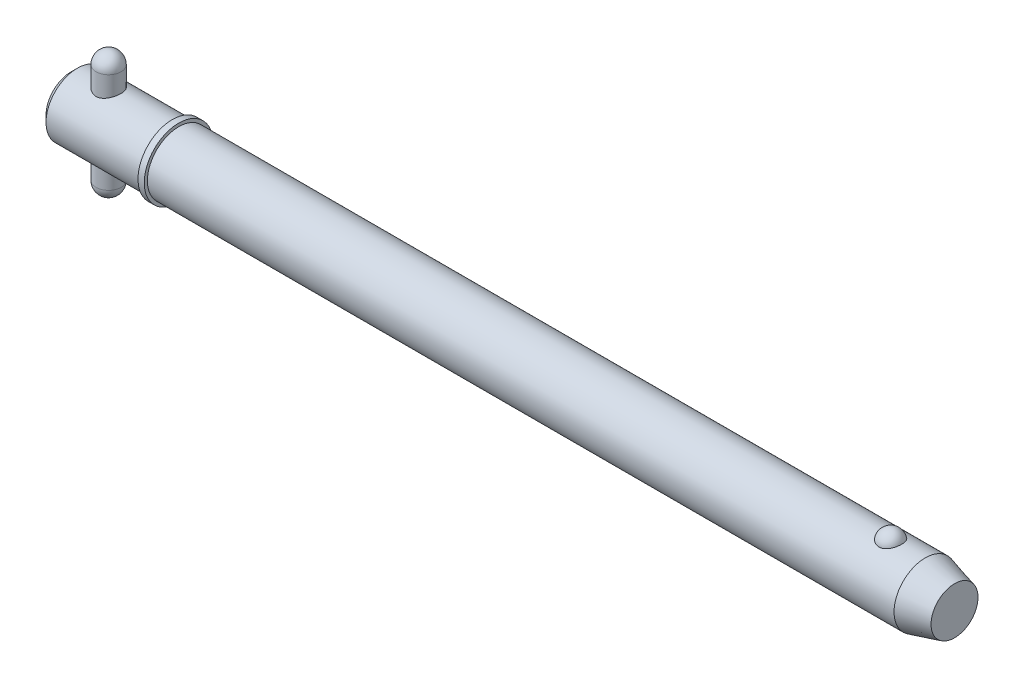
ISO-10303-21;
HEADER;
FILE_DESCRIPTION(('STEP AP214'),'2;1');
FILE_NAME('part.step','',(''),(''),'','','');
FILE_SCHEMA(('AUTOMOTIVE_DESIGN { 1 0 10303 214 1 1 1 1 }'));
ENDSEC;
DATA;
#1=APPLICATION_CONTEXT('core data for automotive mechanical design processes');
#2=APPLICATION_PROTOCOL_DEFINITION('international standard','automotive_design',2000,#1);
#3=PRODUCT_CONTEXT('',#1,'mechanical');
#4=PRODUCT('Part','Part','',(#3));
#5=PRODUCT_RELATED_PRODUCT_CATEGORY('part','',(#4));
#6=PRODUCT_DEFINITION_FORMATION('','',#4);
#7=PRODUCT_DEFINITION_CONTEXT('part definition',#1,'design');
#8=PRODUCT_DEFINITION('design','',#6,#7);
#9=PRODUCT_DEFINITION_SHAPE('','',#8);
#10=(LENGTH_UNIT() NAMED_UNIT(*) SI_UNIT(.MILLI.,.METRE.));
#11=(NAMED_UNIT(*) PLANE_ANGLE_UNIT() SI_UNIT($,.RADIAN.));
#12=(NAMED_UNIT(*) SI_UNIT($,.STERADIAN.) SOLID_ANGLE_UNIT());
#13=UNCERTAINTY_MEASURE_WITH_UNIT(LENGTH_MEASURE(1.E-05),#10,'distance_accuracy_value','');
#14=(GEOMETRIC_REPRESENTATION_CONTEXT(3) GLOBAL_UNCERTAINTY_ASSIGNED_CONTEXT((#13)) GLOBAL_UNIT_ASSIGNED_CONTEXT((#10,
#11,#12)) REPRESENTATION_CONTEXT('',''));
#15=CARTESIAN_POINT('',(0.,0.,0.));
#16=DIRECTION('',(0.,0.,1.));
#17=DIRECTION('',(1.,0.,0.));
#18=AXIS2_PLACEMENT_3D('',#15,#16,#17);
#19=CARTESIAN_POINT('',(9.525,15.875,0.));
#20=DIRECTION('',(0.,-1.,0.));
#21=DIRECTION('',(0.,0.,-1.));
#22=AXIS2_PLACEMENT_3D('',#19,#20,#21);
#23=CYLINDRICAL_SURFACE('',#22,3.175);
#24=CARTESIAN_POINT('',(9.525,-12.7,0.));
#25=DIRECTION('',(0.,-1.,0.));
#26=DIRECTION('',(0.,0.,-1.));
#27=AXIS2_PLACEMENT_3D('',#24,#25,#26);
#28=CIRCLE('',#27,3.175);
#29=CARTESIAN_POINT('',(9.525,-12.7,-3.175));
#30=VERTEX_POINT('',#29);
#31=EDGE_CURVE('P0_E10',#30,#30,#28,.F.);
#32=ORIENTED_EDGE('',*,*,#31,.T.);
#33=EDGE_LOOP('',(#32));
#34=FACE_BOUND('',#33,.T.);
#35=CARTESIAN_POINT('',(9.525,12.7,0.));
#36=DIRECTION('',(0.,-1.,0.));
#37=DIRECTION('',(0.,0.,-1.));
#38=AXIS2_PLACEMENT_3D('',#35,#36,#37);
#39=CIRCLE('',#38,3.175);
#40=CARTESIAN_POINT('',(9.525,12.7,-3.175));
#41=VERTEX_POINT('',#40);
#42=EDGE_CURVE('P0_E21',#41,#41,#39,.T.);
#43=ORIENTED_EDGE('',*,*,#42,.T.);
#44=EDGE_LOOP('',(#43));
#45=FACE_BOUND('',#44,.T.);
#46=ADVANCED_FACE('P0_F14',(#34,#45),#23,.T.);
#47=CARTESIAN_POINT('',(9.525,-12.7,0.));
#48=DIRECTION('',(0.,0.,1.));
#49=DIRECTION('',(1.,0.,0.));
#50=AXIS2_PLACEMENT_3D('',#47,#48,#49);
#51=SPHERICAL_SURFACE('',#50,3.175);
#52=CARTESIAN_POINT('',(9.525,-12.7,0.));
#53=DIRECTION('',(0.,-1.,0.));
#54=DIRECTION('',(0.,0.,-1.));
#55=AXIS2_PLACEMENT_3D('',#52,#53,#54);
#56=SPHERICAL_SURFACE('',#55,3.175);
#57=ORIENTED_EDGE('',*,*,#31,.F.);
#58=EDGE_LOOP('',(#57));
#59=FACE_BOUND('',#58,.T.);
#60=ADVANCED_FACE('P0_F29',(#59),#56,.T.);
#61=CARTESIAN_POINT('',(9.525,12.7,0.));
#62=DIRECTION('',(0.,0.,1.));
#63=DIRECTION('',(1.,0.,0.));
#64=AXIS2_PLACEMENT_3D('',#61,#62,#63);
#65=SPHERICAL_SURFACE('',#64,3.175);
#66=CARTESIAN_POINT('',(9.525,12.7,0.));
#67=DIRECTION('',(0.,-1.,0.));
#68=DIRECTION('',(0.,0.,-1.));
#69=AXIS2_PLACEMENT_3D('',#66,#67,#68);
#70=SPHERICAL_SURFACE('',#69,3.175);
#71=ORIENTED_EDGE('',*,*,#42,.F.);
#72=EDGE_LOOP('',(#71));
#73=FACE_BOUND('',#72,.T.);
#74=ADVANCED_FACE('P0_F16',(#73),#70,.T.);
#75=CLOSED_SHELL('',(#46,#60,#74));
#76=MANIFOLD_SOLID_BREP('P0_B1',#75);
#77=CARTESIAN_POINT('',(0.,0.,0.));
#78=DIRECTION('',(1.,0.,0.));
#79=DIRECTION('',(0.,0.,-1.));
#80=AXIS2_PLACEMENT_3D('',#77,#78,#79);
#81=CYLINDRICAL_SURFACE('',#80,7.94);
#82=CARTESIAN_POINT('',(216.751879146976,0.,0.));
#83=DIRECTION('',(1.,0.,0.));
#84=DIRECTION('',(0.,0.,-1.));
#85=AXIS2_PLACEMENT_3D('',#82,#83,#84);
#86=CIRCLE('',#85,7.94);
#87=CARTESIAN_POINT('',(216.751879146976,0.,-7.94));
#88=VERTEX_POINT('',#87);
#89=EDGE_CURVE('P1_E81',#88,#88,#86,.T.);
#90=ORIENTED_EDGE('',*,*,#89,.F.);
#91=EDGE_LOOP('',(#90));
#92=FACE_BOUND('',#91,.T.);
#93=CARTESIAN_POINT('',(27.31,0.,0.));
#94=DIRECTION('',(1.,0.,0.));
#95=DIRECTION('',(0.,0.,-1.));
#96=AXIS2_PLACEMENT_3D('',#93,#94,#95);
#97=CIRCLE('',#96,7.94);
#98=CARTESIAN_POINT('',(27.31,0.,-7.94));
#99=VERTEX_POINT('',#98);
#100=EDGE_CURVE('P1_E85',#99,#99,#97,.T.);
#101=ORIENTED_EDGE('',*,*,#100,.T.);
#102=EDGE_LOOP('',(#101));
#103=FACE_BOUND('',#102,.T.);
#104=CARTESIAN_POINT('',(207.944907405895,7.37767842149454,2.93486986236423));
#105=CARTESIAN_POINT('',(207.792749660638,7.3776732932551,2.93487505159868));
#106=CARTESIAN_POINT('',(207.640632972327,7.38258419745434,2.92262454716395));
#107=CARTESIAN_POINT('',(207.340928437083,7.40163229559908,2.87404196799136));
#108=CARTESIAN_POINT('',(207.193339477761,7.41576720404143,2.83771585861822));
#109=CARTESIAN_POINT('',(206.907018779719,7.45161576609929,2.74218769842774));
#110=CARTESIAN_POINT('',(206.768274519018,7.47331841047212,2.68301886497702));
#111=CARTESIAN_POINT('',(206.502882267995,7.52194082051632,2.54350967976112));
#112=CARTESIAN_POINT('',(206.376236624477,7.54886159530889,2.46316523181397));
#113=CARTESIAN_POINT('',(206.134534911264,7.60594671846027,2.28090375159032));
#114=CARTESIAN_POINT('',(206.019906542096,7.63618114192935,2.1784421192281));
#115=CARTESIAN_POINT('',(205.808878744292,7.69614046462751,1.95608495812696));
#116=CARTESIAN_POINT('',(205.712482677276,7.72586526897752,1.83618622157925));
#117=CARTESIAN_POINT('',(205.535938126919,7.78314821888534,1.57628086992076));
#118=CARTESIAN_POINT('',(205.456707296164,7.81055035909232,1.43561546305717));
#119=CARTESIAN_POINT('',(205.321797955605,7.85879631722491,1.14236334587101));
#120=CARTESIAN_POINT('',(205.266121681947,7.87963951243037,0.989775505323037));
#121=CARTESIAN_POINT('',(205.17881215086,7.91289645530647,0.674619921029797));
#122=CARTESIAN_POINT('',(205.14753090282,7.92518652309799,0.511941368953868));
#123=CARTESIAN_POINT('',(205.110975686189,7.93958930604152,0.183247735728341));
#124=CARTESIAN_POINT('',(205.105701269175,7.94170219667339,0.0172327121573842));
#125=CARTESIAN_POINT('',(205.121231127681,7.93554931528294,-0.312672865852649));
#126=CARTESIAN_POINT('',(205.141925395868,7.92732732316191,-0.476569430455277));
#127=CARTESIAN_POINT('',(205.20878655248,7.90141534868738,-0.79830524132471));
#128=CARTESIAN_POINT('',(205.254953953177,7.88372517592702,-0.956144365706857));
#129=CARTESIAN_POINT('',(205.371898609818,7.84066230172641,-1.26152073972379));
#130=CARTESIAN_POINT('',(205.442704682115,7.81528060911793,-1.40904568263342));
#131=CARTESIAN_POINT('',(205.607478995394,7.75948672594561,-1.68950598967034));
#132=CARTESIAN_POINT('',(205.701448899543,7.72907417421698,-1.82244030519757));
#133=CARTESIAN_POINT('',(205.910839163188,7.66640424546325,-2.07032792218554));
#134=CARTESIAN_POINT('',(206.026315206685,7.63414223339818,-2.18523308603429));
#135=CARTESIAN_POINT('',(206.2759006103,7.57149681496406,-2.39329737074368));
#136=CARTESIAN_POINT('',(206.410008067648,7.54111321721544,-2.48645870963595));
#137=CARTESIAN_POINT('',(206.690111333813,7.48650742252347,-2.64628132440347));
#138=CARTESIAN_POINT('',(206.835760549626,7.46215900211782,-2.71350554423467));
#139=CARTESIAN_POINT('',(207.137425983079,7.42171253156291,-2.82226614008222));
#140=CARTESIAN_POINT('',(207.293438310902,7.40561140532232,-2.86381209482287));
#141=CARTESIAN_POINT('',(207.602970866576,7.3842679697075,-2.9183907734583));
#142=CARTESIAN_POINT('',(207.756222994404,7.37852109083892,-2.93275024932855));
#143=CARTESIAN_POINT('',(208.063070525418,7.37700973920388,-2.93655208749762));
#144=CARTESIAN_POINT('',(208.216665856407,7.38124333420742,-2.92599927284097));
#145=CARTESIAN_POINT('',(208.514990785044,7.39890635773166,-2.88102897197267));
#146=CARTESIAN_POINT('',(208.659848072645,7.41205491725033,-2.84733999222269));
#147=CARTESIAN_POINT('',(208.94164329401,7.445801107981,-2.75788206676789));
#148=CARTESIAN_POINT('',(209.078580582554,7.46639934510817,-2.70211132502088));
#149=CARTESIAN_POINT('',(209.344061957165,7.51339098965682,-2.56858908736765));
#150=CARTESIAN_POINT('',(209.472354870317,7.53990200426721,-2.4903806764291));
#151=CARTESIAN_POINT('',(209.714244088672,7.59569503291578,-2.31462737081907));
#152=CARTESIAN_POINT('',(209.827837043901,7.6249776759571,-2.21707808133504));
#153=CARTESIAN_POINT('',(210.04322156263,7.68489473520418,-1.99982049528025));
#154=CARTESIAN_POINT('',(210.144148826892,7.71552419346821,-1.87925337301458));
#155=CARTESIAN_POINT('',(210.325186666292,7.77353016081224,-1.6226882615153));
#156=CARTESIAN_POINT('',(210.405293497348,7.80090608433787,-1.48668750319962));
#157=CARTESIAN_POINT('',(210.545361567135,7.85047992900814,-1.1981841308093));
#158=CARTESIAN_POINT('',(210.604587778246,7.87248183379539,-1.04529016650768));
#159=CARTESIAN_POINT('',(210.697982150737,7.90785114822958,-0.731080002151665));
#160=CARTESIAN_POINT('',(210.732149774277,7.92121837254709,-0.569763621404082));
#161=CARTESIAN_POINT('',(210.774795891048,7.93797834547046,-0.242812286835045));
#162=CARTESIAN_POINT('',(210.783204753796,7.94134405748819,-0.0771668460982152));
#163=CARTESIAN_POINT('',(210.773962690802,7.93767937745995,0.253276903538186));
#164=CARTESIAN_POINT('',(210.756312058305,7.93064910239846,0.418075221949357));
#165=CARTESIAN_POINT('',(210.695424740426,7.90695571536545,0.741525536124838));
#166=CARTESIAN_POINT('',(210.652281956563,7.8903279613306,0.900197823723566));
#167=CARTESIAN_POINT('',(210.54135358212,7.84916386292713,1.20759654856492));
#168=CARTESIAN_POINT('',(210.47356656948,7.82462706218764,1.35632241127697));
#169=CARTESIAN_POINT('',(210.314371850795,7.77006699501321,1.64032869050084));
#170=CARTESIAN_POINT('',(210.222861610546,7.74002008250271,1.7755471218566));
#171=CARTESIAN_POINT('',(210.018296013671,7.67774175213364,2.0280064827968));
#172=CARTESIAN_POINT('',(209.905241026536,7.64551037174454,2.14524772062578));
#173=CARTESIAN_POINT('',(209.660831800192,7.58265895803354,2.35778002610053));
#174=CARTESIAN_POINT('',(209.529583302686,7.5520309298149,2.45319004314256));
#175=CARTESIAN_POINT('',(209.251601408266,7.49579792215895,2.61999897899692));
#176=CARTESIAN_POINT('',(209.104867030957,7.4701932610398,2.69139637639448));
#177=CARTESIAN_POINT('',(208.792947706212,7.42622216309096,2.8105324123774));
#178=CARTESIAN_POINT('',(208.627220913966,7.40825002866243,2.85700910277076));
#179=CARTESIAN_POINT('',(208.289279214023,7.38398348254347,2.9191685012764));
#180=CARTESIAN_POINT('',(208.11706702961,7.3776842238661,2.93486399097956));
#181=CARTESIAN_POINT('',(207.944907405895,7.37767842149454,2.93486986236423));
#182=B_SPLINE_CURVE_WITH_KNOTS('',3,(#104,#105,#106,#107,#108,#109,#110,#111,#112,#113,#114,
#115,#116,#117,#118,#119,#120,#121,#122,#123,#124,#125,#126,#127,#128,#129,#130,#131,#132,#133,
#134,#135,#136,#137,#138,#139,#140,#141,#142,#143,#144,#145,#146,#147,#148,#149,#150,#151,#152,
#153,#154,#155,#156,#157,#158,#159,#160,#161,#162,#163,#164,#165,#166,#167,#168,#169,#170,#171,
#172,#173,#174,#175,#176,#177,#178,#179,#180,#181),.UNSPECIFIED.,.T.,.F.,(4,2,2,2,2,2,2,2,2,2,2,
2,2,2,2,2,2,2,2,2,2,2,2,2,2,2,2,2,2,2,2,2,2,2,2,2,2,2,4),(0.,0.455841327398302,
0.911569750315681,1.36663794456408,1.82179423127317,2.2897898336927,2.75787163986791,
3.24685368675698,3.73588214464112,4.23184282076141,4.72779494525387,5.22165321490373,
5.71552141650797,6.20996917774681,6.7044524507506,7.20023431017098,7.69596557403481,
8.18023418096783,8.66432203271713,9.12410697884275,9.58380291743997,10.0296503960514,
10.4755341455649,10.9312349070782,11.3870393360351,11.8654416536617,12.3439299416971,
12.8378875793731,13.3318558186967,13.8271581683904,14.3224549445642,14.8159385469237,
15.3094506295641,15.8051323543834,16.3008055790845,16.7937101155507,17.2866458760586,
17.8026240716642,18.3183879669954),.UNSPECIFIED.);
#183=CARTESIAN_POINT('',(207.944907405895,7.37767842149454,2.93486986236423));
#184=VERTEX_POINT('',#183);
#185=EDGE_CURVE('P1_E35',#184,#184,#182,.T.);
#186=ORIENTED_EDGE('',*,*,#185,.T.);
#187=EDGE_LOOP('',(#186));
#188=FACE_BOUND('',#187,.T.);
#189=ADVANCED_FACE('P1_F13',(#92,#103,#188),#81,.T.);
#190=CARTESIAN_POINT('',(0.,0.,0.));
#191=DIRECTION('',(-1.,0.,0.));
#192=DIRECTION('',(0.,0.,1.));
#193=AXIS2_PLACEMENT_3D('',#190,#191,#192);
#194=PLANE('',#193);
#195=CARTESIAN_POINT('',(0.,0.,0.));
#196=DIRECTION('',(1.,0.,0.));
#197=DIRECTION('',(0.,0.,-1.));
#198=AXIS2_PLACEMENT_3D('',#195,#196,#197);
#199=CIRCLE('',#198,6.352);
#200=CARTESIAN_POINT('',(0.,0.,-6.352));
#201=VERTEX_POINT('',#200);
#202=EDGE_CURVE('P1_E9',#201,#201,#199,.T.);
#203=ORIENTED_EDGE('',*,*,#202,.F.);
#204=EDGE_LOOP('',(#203));
#205=FACE_BOUND('',#204,.T.);
#206=ADVANCED_FACE('P1_F15',(#205),#194,.T.);
#207=CARTESIAN_POINT('',(1.58799999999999,0.,0.));
#208=DIRECTION('',(1.,0.,0.));
#209=DIRECTION('',(0.,0.,-1.));
#210=AXIS2_PLACEMENT_3D('',#207,#208,#209);
#211=CONICAL_SURFACE('',#210,7.94,0.78539816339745);
#212=ORIENTED_EDGE('',*,*,#202,.T.);
#213=EDGE_LOOP('',(#212));
#214=FACE_BOUND('',#213,.T.);
#215=CARTESIAN_POINT('',(1.58799999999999,0.,0.));
#216=DIRECTION('',(1.,0.,0.));
#217=DIRECTION('',(0.,0.,-1.));
#218=AXIS2_PLACEMENT_3D('',#215,#216,#217);
#219=CIRCLE('',#218,7.94);
#220=CARTESIAN_POINT('',(1.58799999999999,0.,-7.94));
#221=VERTEX_POINT('',#220);
#222=EDGE_CURVE('P1_E26',#221,#221,#219,.T.);
#223=ORIENTED_EDGE('',*,*,#222,.F.);
#224=EDGE_LOOP('',(#223));
#225=FACE_BOUND('',#224,.T.);
#226=ADVANCED_FACE('P1_F77',(#214,#225),#211,.T.);
#227=CARTESIAN_POINT('',(0.,0.,0.));
#228=DIRECTION('',(1.,0.,0.));
#229=DIRECTION('',(0.,0.,-1.));
#230=AXIS2_PLACEMENT_3D('',#227,#228,#229);
#231=CYLINDRICAL_SURFACE('',#230,7.94);
#232=CARTESIAN_POINT('',(9.525,-7.27756655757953,3.175));
#233=CARTESIAN_POINT('',(9.43992346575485,-7.27756715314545,3.17499935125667));
#234=CARTESIAN_POINT('',(9.35481882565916,-7.27906496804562,3.1715736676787));
#235=CARTESIAN_POINT('',(9.18524505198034,-7.28499816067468,3.15791803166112));
#236=CARTESIAN_POINT('',(9.100776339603,-7.28943533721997,3.14768391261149));
#237=CARTESIAN_POINT('',(8.84895715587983,-7.30698881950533,3.10684226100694));
#238=CARTESIAN_POINT('',(8.6834173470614,-7.32434654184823,3.06609574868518));
#239=CARTESIAN_POINT('',(8.36278910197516,-7.36806950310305,2.95945910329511));
#240=CARTESIAN_POINT('',(8.20766386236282,-7.39440078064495,2.89366366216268));
#241=CARTESIAN_POINT('',(7.91065319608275,-7.45304562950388,2.73907413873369));
#242=CARTESIAN_POINT('',(7.76876488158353,-7.48535789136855,2.65028508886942));
#243=CARTESIAN_POINT('',(7.49411086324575,-7.55439482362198,2.44679888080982));
#244=CARTESIAN_POINT('',(7.36219910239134,-7.59126138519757,2.33099745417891));
#245=CARTESIAN_POINT('',(7.11904234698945,-7.66408045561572,2.07909838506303));
#246=CARTESIAN_POINT('',(7.00780457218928,-7.70003264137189,1.94299368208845));
#247=CARTESIAN_POINT('',(6.80492173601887,-7.76867514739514,1.64775981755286));
#248=CARTESIAN_POINT('',(6.71422139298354,-7.80118112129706,1.48793473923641));
#249=CARTESIAN_POINT('',(6.56135788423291,-7.85754918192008,1.15376269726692));
#250=CARTESIAN_POINT('',(6.49918311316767,-7.88141478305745,0.979421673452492));
#251=CARTESIAN_POINT('',(6.40818142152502,-7.91680873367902,0.630115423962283));
#252=CARTESIAN_POINT('',(6.3778864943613,-7.9288781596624,0.455588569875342));
#253=CARTESIAN_POINT('',(6.34677743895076,-7.94127547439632,0.103539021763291));
#254=CARTESIAN_POINT('',(6.34595232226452,-7.94160773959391,-0.0739825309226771));
#255=CARTESIAN_POINT('',(6.37300128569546,-7.93082261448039,-0.416371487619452));
#256=CARTESIAN_POINT('',(6.39926693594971,-7.92034690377,-0.581389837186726));
#257=CARTESIAN_POINT('',(6.47701615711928,-7.88998770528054,-0.904449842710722));
#258=CARTESIAN_POINT('',(6.52850157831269,-7.87010352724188,-1.06249098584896));
#259=CARTESIAN_POINT('',(6.65586120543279,-7.82249343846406,-1.36995769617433));
#260=CARTESIAN_POINT('',(6.73209124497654,-7.79465387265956,-1.51921754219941));
#261=CARTESIAN_POINT('',(6.90644286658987,-7.73389606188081,-1.80321183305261));
#262=CARTESIAN_POINT('',(7.00457194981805,-7.70097607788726,-1.93794127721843));
#263=CARTESIAN_POINT('',(7.22744086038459,-7.63084889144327,-2.19843606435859));
#264=CARTESIAN_POINT('',(7.35350432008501,-7.59350211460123,-2.3230330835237));
#265=CARTESIAN_POINT('',(7.62488266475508,-7.52039654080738,-2.54979642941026));
#266=CARTESIAN_POINT('',(7.77020381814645,-7.48463826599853,-2.65195542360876));
#267=CARTESIAN_POINT('',(8.08119298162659,-7.41780943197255,-2.83361305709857));
#268=CARTESIAN_POINT('',(8.24731937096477,-7.38689959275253,-2.91239105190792));
#269=CARTESIAN_POINT('',(8.59204539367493,-7.33515216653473,-3.04038913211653));
#270=CARTESIAN_POINT('',(8.77063684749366,-7.31430804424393,-3.08962840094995));
#271=CARTESIAN_POINT('',(9.12356982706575,-7.28663831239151,-3.15431018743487));
#272=CARTESIAN_POINT('',(9.29750494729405,-7.2790344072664,-3.17163284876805));
#273=CARTESIAN_POINT('',(9.64592502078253,-7.27648884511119,-3.17747282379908));
#274=CARTESIAN_POINT('',(9.82040979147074,-7.28154335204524,-3.16599886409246));
#275=CARTESIAN_POINT('',(10.1545374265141,-7.30294638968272,-3.11628310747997));
#276=CARTESIAN_POINT('',(10.3144598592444,-7.31863587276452,-3.0796016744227));
#277=CARTESIAN_POINT('',(10.625774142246,-7.35872371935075,-2.98253618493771));
#278=CARTESIAN_POINT('',(10.7771640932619,-7.38312401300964,-2.92214687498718));
#279=CARTESIAN_POINT('',(11.0739599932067,-7.4390944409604,-2.77664664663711));
#280=CARTESIAN_POINT('',(11.2188745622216,-7.47091513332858,-2.69063278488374));
#281=CARTESIAN_POINT('',(11.4928722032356,-7.53775867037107,-2.49724834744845));
#282=CARTESIAN_POINT('',(11.6219487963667,-7.57278281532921,-2.38986907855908));
#283=CARTESIAN_POINT('',(11.8705091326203,-7.64520845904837,-2.1474449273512));
#284=CARTESIAN_POINT('',(11.9885816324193,-7.68259462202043,-2.01094304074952));
#285=CARTESIAN_POINT('',(12.2003631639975,-7.75309951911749,-1.71917041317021));
#286=CARTESIAN_POINT('',(12.2940712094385,-7.78621808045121,-1.56389891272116));
#287=CARTESIAN_POINT('',(12.4541161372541,-7.84456050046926,-1.23845027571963));
#288=CARTESIAN_POINT('',(12.5204600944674,-7.86978639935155,-1.06827700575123));
#289=CARTESIAN_POINT('',(12.6231407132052,-7.90943635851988,-0.717928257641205));
#290=CARTESIAN_POINT('',(12.6594936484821,-7.92386627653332,-0.537758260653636));
#291=CARTESIAN_POINT('',(12.6992281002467,-7.93967263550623,-0.185201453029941));
#292=CARTESIAN_POINT('',(12.7046050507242,-7.94183891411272,-0.0130732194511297));
#293=CARTESIAN_POINT('',(12.6875036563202,-7.9350072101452,0.329549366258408));
#294=CARTESIAN_POINT('',(12.6650295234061,-7.92601091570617,0.500043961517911));
#295=CARTESIAN_POINT('',(12.5942896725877,-7.89825976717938,0.829196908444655));
#296=CARTESIAN_POINT('',(12.5468364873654,-7.87981280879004,0.988057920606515));
#297=CARTESIAN_POINT('',(12.4283390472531,-7.83513565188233,1.29553461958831));
#298=CARTESIAN_POINT('',(12.3572904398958,-7.8089040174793,1.44414841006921));
#299=CARTESIAN_POINT('',(12.1900822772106,-7.7497911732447,1.73412879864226));
#300=CARTESIAN_POINT('',(12.0929519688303,-7.71666737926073,1.87488510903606));
#301=CARTESIAN_POINT('',(11.8777894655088,-7.64775894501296,2.13869231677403));
#302=CARTESIAN_POINT('',(11.7597486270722,-7.61197320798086,2.26173585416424));
#303=CARTESIAN_POINT('',(11.4974896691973,-7.53902341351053,2.49449755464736));
#304=CARTESIAN_POINT('',(11.3521039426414,-7.50191102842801,2.60292060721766));
#305=CARTESIAN_POINT('',(11.0440201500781,-7.43289551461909,2.79392602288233));
#306=CARTESIAN_POINT('',(10.8813200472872,-7.40099299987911,2.87650534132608));
#307=CARTESIAN_POINT('',(10.558064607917,-7.3489506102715,3.00682739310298));
#308=CARTESIAN_POINT('',(10.398627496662,-7.32801197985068,3.05703164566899));
#309=CARTESIAN_POINT('',(10.0731242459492,-7.29639491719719,3.13175843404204));
#310=CARTESIAN_POINT('',(9.90707793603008,-7.28568789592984,3.15635254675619));
#311=CARTESIAN_POINT('',(9.70441566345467,-7.27968826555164,3.17013149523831));
#312=CARTESIAN_POINT('',(9.66856669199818,-7.27889378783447,3.17195593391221));
#313=CARTESIAN_POINT('',(9.59681348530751,-7.27783278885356,3.17439036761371));
#314=CARTESIAN_POINT('',(9.56090924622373,-7.27756630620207,3.17500027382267));
#315=CARTESIAN_POINT('',(9.525,-7.27756655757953,3.175));
#316=B_SPLINE_CURVE_WITH_KNOTS('',3,(#232,#233,#234,#235,#236,#237,#238,#239,#240,#241,#242,
#243,#244,#245,#246,#247,#248,#249,#250,#251,#252,#253,#254,#255,#256,#257,#258,#259,#260,#261,
#262,#263,#264,#265,#266,#267,#268,#269,#270,#271,#272,#273,#274,#275,#276,#277,#278,#279,#280,
#281,#282,#283,#284,#285,#286,#287,#288,#289,#290,#291,#292,#293,#294,#295,#296,#297,#298,#299,
#300,#301,#302,#303,#304,#305,#306,#307,#308,#309,#310,#311,#312,#313,#314,#315),.UNSPECIFIED.,
.T.,.F.,(4,2,2,2,2,2,2,2,2,2,2,2,2,2,2,2,2,2,2,2,2,2,2,2,2,2,2,2,2,2,2,2,2,2,2,2,2,2,2,2,2,4),
(0.,0.255187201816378,0.510530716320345,1.0218798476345,1.53131482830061,2.04063840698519,
2.57635929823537,3.11226692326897,3.66929090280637,4.22608806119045,4.75594400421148,
5.28560237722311,5.78552836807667,6.28549104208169,6.79298787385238,7.30065880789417,
7.8416422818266,8.38280228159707,8.93923025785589,9.49529647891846,10.0174074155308,
10.5393601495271,11.0316114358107,11.5239718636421,12.0362920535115,12.5488211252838,
13.0991799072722,13.6495609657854,14.1997996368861,14.7497395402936,15.2638187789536,
15.7778202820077,16.2760504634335,16.7743726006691,17.294711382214,17.8152657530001,
18.3680208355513,18.9208410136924,19.4240423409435,19.9258334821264,20.0335354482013,
20.1412452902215),.UNSPECIFIED.);
#317=CARTESIAN_POINT('',(9.525,-7.27756655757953,3.175));
#318=VERTEX_POINT('',#317);
#319=EDGE_CURVE('P1_E17',#318,#318,#316,.T.);
#320=ORIENTED_EDGE('',*,*,#319,.F.);
#321=EDGE_LOOP('',(#320));
#322=FACE_BOUND('',#321,.T.);
#323=CARTESIAN_POINT('',(9.525,7.27756655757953,3.175));
#324=CARTESIAN_POINT('',(9.61007653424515,7.27756715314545,3.17499935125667));
#325=CARTESIAN_POINT('',(9.69518117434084,7.27906496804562,3.1715736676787));
#326=CARTESIAN_POINT('',(9.86475494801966,7.28499816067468,3.15791803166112));
#327=CARTESIAN_POINT('',(9.949223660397,7.28943533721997,3.14768391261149));
#328=CARTESIAN_POINT('',(10.2010428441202,7.30698881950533,3.10684226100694));
#329=CARTESIAN_POINT('',(10.3665826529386,7.32434654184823,3.06609574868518));
#330=CARTESIAN_POINT('',(10.6872108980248,7.36806950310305,2.95945910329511));
#331=CARTESIAN_POINT('',(10.8423361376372,7.39440078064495,2.89366366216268));
#332=CARTESIAN_POINT('',(11.1393468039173,7.45304562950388,2.73907413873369));
#333=CARTESIAN_POINT('',(11.2812351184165,7.48535789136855,2.65028508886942));
#334=CARTESIAN_POINT('',(11.5558891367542,7.55439482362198,2.44679888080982));
#335=CARTESIAN_POINT('',(11.6878008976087,7.59126138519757,2.33099745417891));
#336=CARTESIAN_POINT('',(11.9309576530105,7.66408045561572,2.07909838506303));
#337=CARTESIAN_POINT('',(12.0421954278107,7.70003264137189,1.94299368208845));
#338=CARTESIAN_POINT('',(12.2450782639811,7.76867514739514,1.64775981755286));
#339=CARTESIAN_POINT('',(12.3357786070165,7.80118112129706,1.48793473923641));
#340=CARTESIAN_POINT('',(12.4886421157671,7.85754918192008,1.15376269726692));
#341=CARTESIAN_POINT('',(12.5508168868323,7.88141478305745,0.979421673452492));
#342=CARTESIAN_POINT('',(12.641818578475,7.91680873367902,0.630115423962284));
#343=CARTESIAN_POINT('',(12.6721135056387,7.9288781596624,0.455588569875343));
#344=CARTESIAN_POINT('',(12.7032225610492,7.94127547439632,0.103539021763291));
#345=CARTESIAN_POINT('',(12.7040476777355,7.94160773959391,-0.0739825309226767));
#346=CARTESIAN_POINT('',(12.6769987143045,7.93082261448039,-0.416371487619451));
#347=CARTESIAN_POINT('',(12.6507330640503,7.92034690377,-0.581389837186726));
#348=CARTESIAN_POINT('',(12.5729838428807,7.88998770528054,-0.904449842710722));
#349=CARTESIAN_POINT('',(12.5214984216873,7.87010352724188,-1.06249098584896));
#350=CARTESIAN_POINT('',(12.3941387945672,7.82249343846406,-1.36995769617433));
#351=CARTESIAN_POINT('',(12.3179087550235,7.79465387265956,-1.51921754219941));
#352=CARTESIAN_POINT('',(12.1435571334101,7.73389606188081,-1.80321183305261));
#353=CARTESIAN_POINT('',(12.0454280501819,7.70097607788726,-1.93794127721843));
#354=CARTESIAN_POINT('',(11.8225591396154,7.63084889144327,-2.19843606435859));
#355=CARTESIAN_POINT('',(11.696495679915,7.59350211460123,-2.3230330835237));
#356=CARTESIAN_POINT('',(11.4251173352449,7.52039654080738,-2.54979642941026));
#357=CARTESIAN_POINT('',(11.2797961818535,7.48463826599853,-2.65195542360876));
#358=CARTESIAN_POINT('',(10.9688070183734,7.41780943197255,-2.83361305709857));
#359=CARTESIAN_POINT('',(10.8026806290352,7.38689959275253,-2.91239105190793));
#360=CARTESIAN_POINT('',(10.4579546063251,7.33515216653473,-3.04038913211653));
#361=CARTESIAN_POINT('',(10.2793631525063,7.31430804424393,-3.08962840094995));
#362=CARTESIAN_POINT('',(9.92643017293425,7.28663831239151,-3.15431018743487));
#363=CARTESIAN_POINT('',(9.75249505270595,7.2790344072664,-3.17163284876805));
#364=CARTESIAN_POINT('',(9.40407497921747,7.2764888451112,-3.17747282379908));
#365=CARTESIAN_POINT('',(9.22959020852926,7.28154335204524,-3.16599886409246));
#366=CARTESIAN_POINT('',(8.89546257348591,7.30294638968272,-3.11628310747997));
#367=CARTESIAN_POINT('',(8.73554014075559,7.31863587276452,-3.0796016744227));
#368=CARTESIAN_POINT('',(8.42422585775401,7.35872371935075,-2.98253618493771));
#369=CARTESIAN_POINT('',(8.27283590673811,7.38312401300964,-2.92214687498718));
#370=CARTESIAN_POINT('',(7.97604000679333,7.4390944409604,-2.77664664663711));
#371=CARTESIAN_POINT('',(7.83112543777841,7.47091513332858,-2.69063278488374));
#372=CARTESIAN_POINT('',(7.55712779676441,7.53775867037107,-2.49724834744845));
#373=CARTESIAN_POINT('',(7.42805120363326,7.57278281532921,-2.38986907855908));
#374=CARTESIAN_POINT('',(7.17949086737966,7.64520845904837,-2.1474449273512));
#375=CARTESIAN_POINT('',(7.06141836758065,7.68259462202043,-2.01094304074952));
#376=CARTESIAN_POINT('',(6.8496368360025,7.75309951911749,-1.71917041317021));
#377=CARTESIAN_POINT('',(6.75592879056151,7.78621808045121,-1.56389891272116));
#378=CARTESIAN_POINT('',(6.59588386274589,7.84456050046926,-1.23845027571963));
#379=CARTESIAN_POINT('',(6.52953990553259,7.86978639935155,-1.06827700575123));
#380=CARTESIAN_POINT('',(6.42685928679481,7.90943635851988,-0.717928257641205));
#381=CARTESIAN_POINT('',(6.39050635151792,7.92386627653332,-0.537758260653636));
#382=CARTESIAN_POINT('',(6.35077189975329,7.93967263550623,-0.18520145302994));
#383=CARTESIAN_POINT('',(6.34539494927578,7.94183891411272,-0.0130732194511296));
#384=CARTESIAN_POINT('',(6.36249634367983,7.9350072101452,0.329549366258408));
#385=CARTESIAN_POINT('',(6.38497047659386,7.92601091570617,0.500043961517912));
#386=CARTESIAN_POINT('',(6.45571032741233,7.89825976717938,0.829196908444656));
#387=CARTESIAN_POINT('',(6.50316351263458,7.87981280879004,0.988057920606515));
#388=CARTESIAN_POINT('',(6.62166095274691,7.83513565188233,1.29553461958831));
#389=CARTESIAN_POINT('',(6.69270956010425,7.8089040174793,1.44414841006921));
#390=CARTESIAN_POINT('',(6.85991772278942,7.7497911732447,1.73412879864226));
#391=CARTESIAN_POINT('',(6.95704803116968,7.71666737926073,1.87488510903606));
#392=CARTESIAN_POINT('',(7.17221053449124,7.64775894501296,2.13869231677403));
#393=CARTESIAN_POINT('',(7.29025137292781,7.61197320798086,2.26173585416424));
#394=CARTESIAN_POINT('',(7.55251033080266,7.53902341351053,2.49449755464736));
#395=CARTESIAN_POINT('',(7.69789605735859,7.50191102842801,2.60292060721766));
#396=CARTESIAN_POINT('',(8.00597984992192,7.43289551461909,2.79392602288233));
#397=CARTESIAN_POINT('',(8.16867995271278,7.40099299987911,2.87650534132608));
#398=CARTESIAN_POINT('',(8.49193539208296,7.3489506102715,3.00682739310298));
#399=CARTESIAN_POINT('',(8.65137250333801,7.32801197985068,3.05703164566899));
#400=CARTESIAN_POINT('',(8.97687575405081,7.29639491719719,3.13175843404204));
#401=CARTESIAN_POINT('',(9.14292206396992,7.28568789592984,3.15635254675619));
#402=CARTESIAN_POINT('',(9.34558433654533,7.27968826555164,3.17013149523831));
#403=CARTESIAN_POINT('',(9.38143330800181,7.27889378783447,3.17195593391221));
#404=CARTESIAN_POINT('',(9.45318651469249,7.27783278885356,3.17439036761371));
#405=CARTESIAN_POINT('',(9.48909075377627,7.27756630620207,3.17500027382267));
#406=CARTESIAN_POINT('',(9.525,7.27756655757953,3.175));
#407=B_SPLINE_CURVE_WITH_KNOTS('',3,(#323,#324,#325,#326,#327,#328,#329,#330,#331,#332,#333,
#334,#335,#336,#337,#338,#339,#340,#341,#342,#343,#344,#345,#346,#347,#348,#349,#350,#351,#352,
#353,#354,#355,#356,#357,#358,#359,#360,#361,#362,#363,#364,#365,#366,#367,#368,#369,#370,#371,
#372,#373,#374,#375,#376,#377,#378,#379,#380,#381,#382,#383,#384,#385,#386,#387,#388,#389,#390,
#391,#392,#393,#394,#395,#396,#397,#398,#399,#400,#401,#402,#403,#404,#405,#406),.UNSPECIFIED.,
.T.,.F.,(4,2,2,2,2,2,2,2,2,2,2,2,2,2,2,2,2,2,2,2,2,2,2,2,2,2,2,2,2,2,2,2,2,2,2,2,2,2,2,2,2,4),
(0.,0.255187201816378,0.510530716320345,1.0218798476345,1.53131482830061,2.04063840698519,
2.57635929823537,3.11226692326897,3.66929090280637,4.22608806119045,4.75594400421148,
5.2856023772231,5.78552836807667,6.28549104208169,6.79298787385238,7.30065880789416,
7.8416422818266,8.38280228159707,8.9392302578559,9.49529647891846,10.0174074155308,
10.5393601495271,11.0316114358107,11.5239718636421,12.0362920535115,12.5488211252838,
13.0991799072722,13.6495609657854,14.1997996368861,14.7497395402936,15.2638187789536,
15.7778202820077,16.2760504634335,16.7743726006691,17.294711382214,17.8152657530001,
18.3680208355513,18.9208410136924,19.4240423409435,19.9258334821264,20.0335354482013,
20.1412452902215),.UNSPECIFIED.);
#408=CARTESIAN_POINT('',(9.525,7.27756655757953,3.175));
#409=VERTEX_POINT('',#408);
#410=EDGE_CURVE('P1_E43',#409,#409,#407,.T.);
#411=ORIENTED_EDGE('',*,*,#410,.F.);
#412=EDGE_LOOP('',(#411));
#413=FACE_BOUND('',#412,.T.);
#414=ORIENTED_EDGE('',*,*,#222,.T.);
#415=EDGE_LOOP('',(#414));
#416=FACE_BOUND('',#415,.T.);
#417=CARTESIAN_POINT('',(25.722,0.,0.));
#418=DIRECTION('',(1.,0.,0.));
#419=DIRECTION('',(0.,0.,-1.));
#420=AXIS2_PLACEMENT_3D('',#417,#418,#419);
#421=CIRCLE('',#420,7.94);
#422=CARTESIAN_POINT('',(25.722,0.,-7.94));
#423=VERTEX_POINT('',#422);
#424=EDGE_CURVE('P1_E31',#423,#423,#421,.T.);
#425=ORIENTED_EDGE('',*,*,#424,.F.);
#426=EDGE_LOOP('',(#425));
#427=FACE_BOUND('',#426,.T.);
#428=ADVANCED_FACE('P1_F103',(#322,#413,#416,#427),#231,.T.);
#429=CARTESIAN_POINT('',(25.722,7.94,0.));
#430=DIRECTION('',(-1.,0.,0.));
#431=DIRECTION('',(0.,0.,1.));
#432=AXIS2_PLACEMENT_3D('',#429,#430,#431);
#433=PLANE('',#432);
#434=ORIENTED_EDGE('',*,*,#424,.T.);
#435=EDGE_LOOP('',(#434));
#436=FACE_BOUND('',#435,.T.);
#437=CARTESIAN_POINT('',(25.722,0.,0.));
#438=DIRECTION('',(1.,0.,0.));
#439=DIRECTION('',(0.,0.,-1.));
#440=AXIS2_PLACEMENT_3D('',#437,#438,#439);
#441=CIRCLE('',#440,8.734);
#442=CARTESIAN_POINT('',(25.722,0.,-8.734));
#443=VERTEX_POINT('',#442);
#444=EDGE_CURVE('P1_E91',#443,#443,#441,.T.);
#445=ORIENTED_EDGE('',*,*,#444,.F.);
#446=EDGE_LOOP('',(#445));
#447=FACE_BOUND('',#446,.T.);
#448=ADVANCED_FACE('P1_F100',(#436,#447),#433,.T.);
#449=CARTESIAN_POINT('',(0.,0.,0.));
#450=DIRECTION('',(1.,0.,0.));
#451=DIRECTION('',(0.,0.,-1.));
#452=AXIS2_PLACEMENT_3D('',#449,#450,#451);
#453=CYLINDRICAL_SURFACE('',#452,8.734);
#454=ORIENTED_EDGE('',*,*,#444,.T.);
#455=EDGE_LOOP('',(#454));
#456=FACE_BOUND('',#455,.T.);
#457=CARTESIAN_POINT('',(27.31,0.,0.));
#458=DIRECTION('',(1.,0.,0.));
#459=DIRECTION('',(0.,0.,-1.));
#460=AXIS2_PLACEMENT_3D('',#457,#458,#459);
#461=CIRCLE('',#460,8.734);
#462=CARTESIAN_POINT('',(27.31,0.,-8.734));
#463=VERTEX_POINT('',#462);
#464=EDGE_CURVE('P1_E88',#463,#463,#461,.T.);
#465=ORIENTED_EDGE('',*,*,#464,.F.);
#466=EDGE_LOOP('',(#465));
#467=FACE_BOUND('',#466,.T.);
#468=ADVANCED_FACE('P1_F68',(#456,#467),#453,.T.);
#469=CARTESIAN_POINT('',(27.31,8.734,0.));
#470=DIRECTION('',(1.,0.,0.));
#471=DIRECTION('',(0.,0.,-1.));
#472=AXIS2_PLACEMENT_3D('',#469,#470,#471);
#473=PLANE('',#472);
#474=ORIENTED_EDGE('',*,*,#464,.T.);
#475=EDGE_LOOP('',(#474));
#476=FACE_BOUND('',#475,.T.);
#477=ORIENTED_EDGE('',*,*,#100,.F.);
#478=EDGE_LOOP('',(#477));
#479=FACE_BOUND('',#478,.T.);
#480=ADVANCED_FACE('P1_F62',(#476,#479),#473,.T.);
#481=CARTESIAN_POINT('',(224.16,0.,0.));
#482=DIRECTION('',(-1.,0.,0.));
#483=DIRECTION('',(0.,0.,1.));
#484=AXIS2_PLACEMENT_3D('',#481,#482,#483);
#485=CONICAL_SURFACE('',#484,5.95500000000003,0.26179938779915);
#486=ORIENTED_EDGE('',*,*,#89,.T.);
#487=EDGE_LOOP('',(#486));
#488=FACE_BOUND('',#487,.T.);
#489=CARTESIAN_POINT('',(224.16,0.,0.));
#490=DIRECTION('',(1.,0.,0.));
#491=DIRECTION('',(0.,0.,-1.));
#492=AXIS2_PLACEMENT_3D('',#489,#490,#491);
#493=CIRCLE('',#492,5.95500000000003);
#494=CARTESIAN_POINT('',(224.16,0.,-5.95500000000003));
#495=VERTEX_POINT('',#494);
#496=EDGE_CURVE('P1_E42',#495,#495,#493,.T.);
#497=ORIENTED_EDGE('',*,*,#496,.F.);
#498=EDGE_LOOP('',(#497));
#499=FACE_BOUND('',#498,.T.);
#500=ADVANCED_FACE('P1_F59',(#488,#499),#485,.T.);
#501=CARTESIAN_POINT('',(224.16,5.95500000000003,0.));
#502=DIRECTION('',(1.,0.,0.));
#503=DIRECTION('',(0.,0.,-1.));
#504=AXIS2_PLACEMENT_3D('',#501,#502,#503);
#505=PLANE('',#504);
#506=ORIENTED_EDGE('',*,*,#496,.T.);
#507=EDGE_LOOP('',(#506));
#508=FACE_BOUND('',#507,.T.);
#509=ADVANCED_FACE('P1_F55',(#508),#505,.T.);
#510=CARTESIAN_POINT('',(207.944907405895,7.146,0.));
#511=DIRECTION('',(-1.,0.,0.));
#512=DIRECTION('',(0.,1.,0.));
#513=AXIS2_PLACEMENT_3D('',#510,#511,#512);
#514=SPHERICAL_SURFACE('',#513,2.944);
#515=ORIENTED_EDGE('',*,*,#185,.F.);
#516=EDGE_LOOP('',(#515));
#517=FACE_BOUND('',#516,.T.);
#518=ADVANCED_FACE('P1_F50',(#517),#514,.T.);
#519=CARTESIAN_POINT('',(9.525,-8.734,0.));
#520=DIRECTION('',(0.,1.,0.));
#521=DIRECTION('',(0.,0.,1.));
#522=AXIS2_PLACEMENT_3D('',#519,#520,#521);
#523=CYLINDRICAL_SURFACE('',#522,3.175);
#524=ORIENTED_EDGE('',*,*,#319,.T.);
#525=EDGE_LOOP('',(#524));
#526=FACE_BOUND('',#525,.T.);
#527=ORIENTED_EDGE('',*,*,#410,.T.);
#528=EDGE_LOOP('',(#527));
#529=FACE_BOUND('',#528,.T.);
#530=ADVANCED_FACE('P1_F54',(#526,#529),#523,.F.);
#531=CLOSED_SHELL('',(#189,#206,#226,#428,#448,#468,#480,#500,#509,#518,#530));
#532=MANIFOLD_SOLID_BREP('P1_B1',#531);
#533=ADVANCED_BREP_SHAPE_REPRESENTATION('',(#18,#76,#532),#14);
#534=SHAPE_DEFINITION_REPRESENTATION(#9,#533);
ENDSEC;
END-ISO-10303-21;
